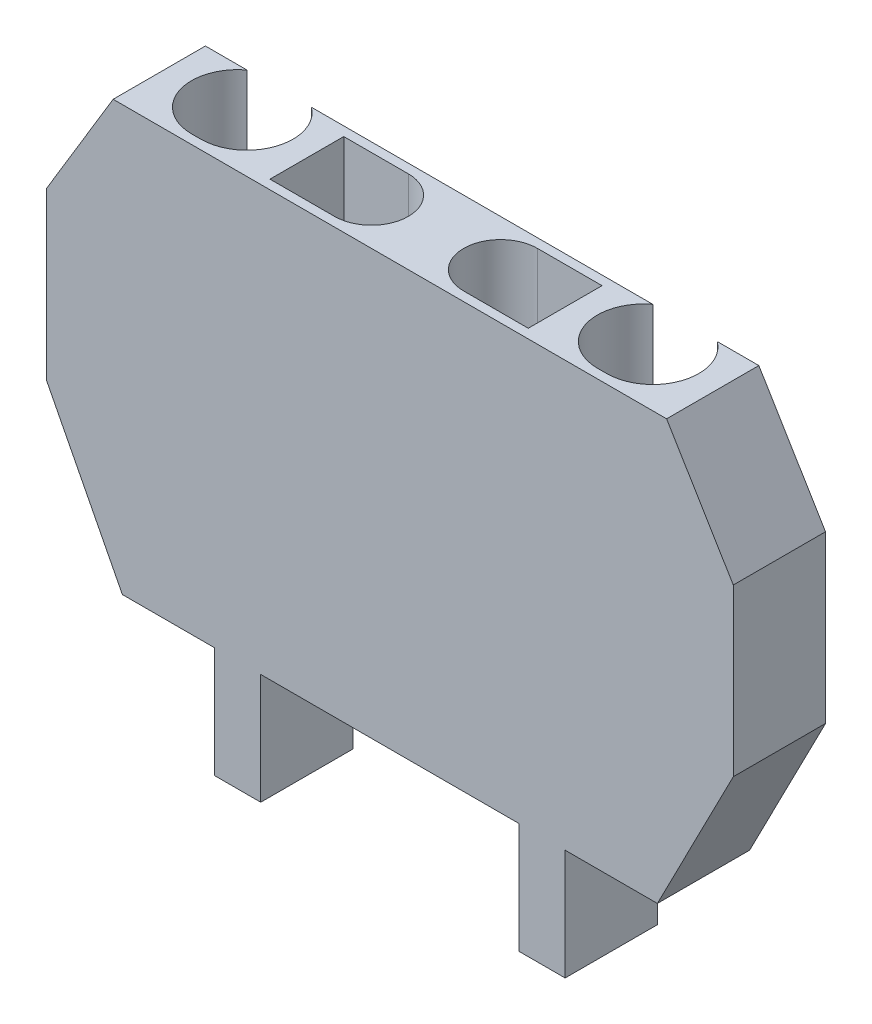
ISO-10303-21;
HEADER;
FILE_DESCRIPTION(('STEP AP214'),'2;1');
FILE_NAME('part.step','',(''),(''),'','','');
FILE_SCHEMA(('AUTOMOTIVE_DESIGN { 1 0 10303 214 1 1 1 1 }'));
ENDSEC;
DATA;
#1=APPLICATION_CONTEXT('core data for automotive mechanical design processes');
#2=APPLICATION_PROTOCOL_DEFINITION('international standard','automotive_design',2000,#1);
#3=PRODUCT_CONTEXT('',#1,'mechanical');
#4=PRODUCT('Part','Part','',(#3));
#5=PRODUCT_RELATED_PRODUCT_CATEGORY('part','',(#4));
#6=PRODUCT_DEFINITION_FORMATION('','',#4);
#7=PRODUCT_DEFINITION_CONTEXT('part definition',#1,'design');
#8=PRODUCT_DEFINITION('design','',#6,#7);
#9=PRODUCT_DEFINITION_SHAPE('','',#8);
#10=(LENGTH_UNIT() NAMED_UNIT(*) SI_UNIT(.MILLI.,.METRE.));
#11=(NAMED_UNIT(*) PLANE_ANGLE_UNIT() SI_UNIT($,.RADIAN.));
#12=(NAMED_UNIT(*) SI_UNIT($,.STERADIAN.) SOLID_ANGLE_UNIT());
#13=UNCERTAINTY_MEASURE_WITH_UNIT(LENGTH_MEASURE(1.E-05),#10,'distance_accuracy_value','');
#14=(GEOMETRIC_REPRESENTATION_CONTEXT(3) GLOBAL_UNCERTAINTY_ASSIGNED_CONTEXT((#13)) GLOBAL_UNIT_ASSIGNED_CONTEXT((#10,
#11,#12)) REPRESENTATION_CONTEXT('',''));
#15=CARTESIAN_POINT('',(0.,0.,0.));
#16=DIRECTION('',(0.,0.,1.));
#17=DIRECTION('',(1.,0.,0.));
#18=AXIS2_PLACEMENT_3D('',#15,#16,#17);
#19=CARTESIAN_POINT('',(7.,0.,5.));
#20=DIRECTION('',(1.,0.,0.));
#21=DIRECTION('',(0.,1.,0.));
#22=AXIS2_PLACEMENT_3D('',#19,#20,#21);
#23=PLANE('',#22);
#24=DIRECTION('',(0.,-1.,0.));
#25=VECTOR('',#24,1.);
#26=CARTESIAN_POINT('',(7.,0.,0.));
#27=LINE('',#26,#25);
#28=CARTESIAN_POINT('',(7.,0.,0.));
#29=VERTEX_POINT('',#28);
#30=CARTESIAN_POINT('',(7.,-6.,0.));
#31=VERTEX_POINT('',#30);
#32=EDGE_CURVE('E333',#29,#31,#27,.T.);
#33=ORIENTED_EDGE('',*,*,#32,.T.);
#34=DIRECTION('',(0.,0.,-1.));
#35=VECTOR('',#34,1.);
#36=CARTESIAN_POINT('',(7.,-6.,5.));
#37=LINE('',#36,#35);
#38=CARTESIAN_POINT('',(7.,-6.,5.));
#39=VERTEX_POINT('',#38);
#40=EDGE_CURVE('E449',#39,#31,#37,.T.);
#41=ORIENTED_EDGE('',*,*,#40,.F.);
#42=DIRECTION('',(0.,-1.,0.));
#43=VECTOR('',#42,1.);
#44=CARTESIAN_POINT('',(7.,0.,5.));
#45=LINE('',#44,#43);
#46=CARTESIAN_POINT('',(7.,0.,5.));
#47=VERTEX_POINT('',#46);
#48=EDGE_CURVE('E336',#47,#39,#45,.T.);
#49=ORIENTED_EDGE('',*,*,#48,.F.);
#50=DIRECTION('',(0.,0.,-1.));
#51=VECTOR('',#50,1.);
#52=CARTESIAN_POINT('',(7.,0.,5.));
#53=LINE('',#52,#51);
#54=EDGE_CURVE('E370',#47,#29,#53,.T.);
#55=ORIENTED_EDGE('',*,*,#54,.T.);
#56=EDGE_LOOP('',(#33,#41,#49,#55));
#57=FACE_BOUND('',#56,.T.);
#58=ADVANCED_FACE('F17',(#57),#23,.F.);
#59=CARTESIAN_POINT('',(7.,-6.,5.));
#60=DIRECTION('',(0.,1.,0.));
#61=DIRECTION('',(0.,0.,1.));
#62=AXIS2_PLACEMENT_3D('',#59,#60,#61);
#63=PLANE('',#62);
#64=DIRECTION('',(1.,0.,0.));
#65=VECTOR('',#64,1.);
#66=CARTESIAN_POINT('',(7.,-6.,0.));
#67=LINE('',#66,#65);
#68=CARTESIAN_POINT('',(9.5,-6.,0.));
#69=VERTEX_POINT('',#68);
#70=EDGE_CURVE('E373',#31,#69,#67,.T.);
#71=ORIENTED_EDGE('',*,*,#70,.T.);
#72=DIRECTION('',(0.,0.,-1.));
#73=VECTOR('',#72,1.);
#74=CARTESIAN_POINT('',(9.5,-6.,5.));
#75=LINE('',#74,#73);
#76=CARTESIAN_POINT('',(9.5,-6.,5.));
#77=VERTEX_POINT('',#76);
#78=EDGE_CURVE('E446',#77,#69,#75,.T.);
#79=ORIENTED_EDGE('',*,*,#78,.F.);
#80=DIRECTION('',(1.,0.,0.));
#81=VECTOR('',#80,1.);
#82=CARTESIAN_POINT('',(7.,-6.,5.));
#83=LINE('',#82,#81);
#84=EDGE_CURVE('E339',#39,#77,#83,.T.);
#85=ORIENTED_EDGE('',*,*,#84,.F.);
#86=ORIENTED_EDGE('',*,*,#40,.T.);
#87=EDGE_LOOP('',(#71,#79,#85,#86));
#88=FACE_BOUND('',#87,.T.);
#89=ADVANCED_FACE('F500',(#88),#63,.F.);
#90=CARTESIAN_POINT('',(9.5,-6.,5.));
#91=DIRECTION('',(-1.,0.,0.));
#92=DIRECTION('',(0.,0.,1.));
#93=AXIS2_PLACEMENT_3D('',#90,#91,#92);
#94=PLANE('',#93);
#95=DIRECTION('',(0.,1.,0.));
#96=VECTOR('',#95,1.);
#97=CARTESIAN_POINT('',(9.5,-6.,0.));
#98=LINE('',#97,#96);
#99=CARTESIAN_POINT('',(9.5,0.,0.));
#100=VERTEX_POINT('',#99);
#101=EDGE_CURVE('E375',#69,#100,#98,.T.);
#102=ORIENTED_EDGE('',*,*,#101,.T.);
#103=DIRECTION('',(0.,0.,-1.));
#104=VECTOR('',#103,1.);
#105=CARTESIAN_POINT('',(9.5,0.,5.));
#106=LINE('',#105,#104);
#107=CARTESIAN_POINT('',(9.5,0.,5.));
#108=VERTEX_POINT('',#107);
#109=EDGE_CURVE('E443',#108,#100,#106,.T.);
#110=ORIENTED_EDGE('',*,*,#109,.F.);
#111=DIRECTION('',(0.,1.,0.));
#112=VECTOR('',#111,1.);
#113=CARTESIAN_POINT('',(9.5,-6.,5.));
#114=LINE('',#113,#112);
#115=EDGE_CURVE('E342',#77,#108,#114,.T.);
#116=ORIENTED_EDGE('',*,*,#115,.F.);
#117=ORIENTED_EDGE('',*,*,#78,.T.);
#118=EDGE_LOOP('',(#102,#110,#116,#117));
#119=FACE_BOUND('',#118,.T.);
#120=ADVANCED_FACE('F496',(#119),#94,.F.);
#121=CARTESIAN_POINT('',(9.5,0.,5.));
#122=DIRECTION('',(0.,1.,0.));
#123=DIRECTION('',(0.,0.,1.));
#124=AXIS2_PLACEMENT_3D('',#121,#122,#123);
#125=PLANE('',#124);
#126=DIRECTION('',(1.,0.,0.));
#127=VECTOR('',#126,1.);
#128=CARTESIAN_POINT('',(9.5,0.,0.));
#129=LINE('',#128,#127);
#130=CARTESIAN_POINT('',(14.5,0.,0.));
#131=VERTEX_POINT('',#130);
#132=EDGE_CURVE('E377',#100,#131,#129,.T.);
#133=ORIENTED_EDGE('',*,*,#132,.T.);
#134=DIRECTION('',(0.,0.,-1.));
#135=VECTOR('',#134,1.);
#136=CARTESIAN_POINT('',(14.5,0.,5.));
#137=LINE('',#136,#135);
#138=CARTESIAN_POINT('',(14.5,0.,5.));
#139=VERTEX_POINT('',#138);
#140=EDGE_CURVE('E440',#139,#131,#137,.T.);
#141=ORIENTED_EDGE('',*,*,#140,.F.);
#142=DIRECTION('',(1.,0.,0.));
#143=VECTOR('',#142,1.);
#144=CARTESIAN_POINT('',(9.5,0.,5.));
#145=LINE('',#144,#143);
#146=EDGE_CURVE('E344',#108,#139,#145,.T.);
#147=ORIENTED_EDGE('',*,*,#146,.F.);
#148=ORIENTED_EDGE('',*,*,#109,.T.);
#149=EDGE_LOOP('',(#133,#141,#147,#148));
#150=FACE_BOUND('',#149,.T.);
#151=ADVANCED_FACE('F491',(#150),#125,.F.);
#152=CARTESIAN_POINT('',(14.5,0.,5.));
#153=DIRECTION('',(-0.889429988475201,0.457071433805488,0.));
#154=DIRECTION('',(-0.457071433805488,-0.889429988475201,0.));
#155=AXIS2_PLACEMENT_3D('',#152,#153,#154);
#156=PLANE('',#155);
#157=DIRECTION('',(0.457071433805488,0.889429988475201,0.));
#158=VECTOR('',#157,1.);
#159=CARTESIAN_POINT('',(14.5,0.,0.));
#160=LINE('',#159,#158);
#161=CARTESIAN_POINT('',(18.6136429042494,8.0048698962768,0.));
#162=VERTEX_POINT('',#161);
#163=EDGE_CURVE('E379',#131,#162,#160,.T.);
#164=ORIENTED_EDGE('',*,*,#163,.T.);
#165=DIRECTION('',(0.,0.,-1.));
#166=VECTOR('',#165,1.);
#167=CARTESIAN_POINT('',(18.6136429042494,8.0048698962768,5.));
#168=LINE('',#167,#166);
#169=CARTESIAN_POINT('',(18.6136429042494,8.0048698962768,5.));
#170=VERTEX_POINT('',#169);
#171=EDGE_CURVE('E437',#170,#162,#168,.T.);
#172=ORIENTED_EDGE('',*,*,#171,.F.);
#173=DIRECTION('',(0.457071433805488,0.889429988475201,0.));
#174=VECTOR('',#173,1.);
#175=CARTESIAN_POINT('',(14.5,0.,5.));
#176=LINE('',#175,#174);
#177=EDGE_CURVE('E346',#139,#170,#176,.T.);
#178=ORIENTED_EDGE('',*,*,#177,.F.);
#179=ORIENTED_EDGE('',*,*,#140,.T.);
#180=EDGE_LOOP('',(#164,#172,#178,#179));
#181=FACE_BOUND('',#180,.T.);
#182=ADVANCED_FACE('F487',(#181),#156,.F.);
#183=CARTESIAN_POINT('',(18.6136429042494,8.0048698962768,5.));
#184=DIRECTION('',(-1.,0.,0.));
#185=DIRECTION('',(0.,0.,1.));
#186=AXIS2_PLACEMENT_3D('',#183,#184,#185);
#187=PLANE('',#186);
#188=DIRECTION('',(0.,1.,0.));
#189=VECTOR('',#188,1.);
#190=CARTESIAN_POINT('',(18.6136429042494,8.0048698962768,0.));
#191=LINE('',#190,#189);
#192=CARTESIAN_POINT('',(18.6136429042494,17.0048698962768,0.));
#193=VERTEX_POINT('',#192);
#194=EDGE_CURVE('E381',#162,#193,#191,.T.);
#195=ORIENTED_EDGE('',*,*,#194,.T.);
#196=DIRECTION('',(0.,0.,-1.));
#197=VECTOR('',#196,1.);
#198=CARTESIAN_POINT('',(18.6136429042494,17.0048698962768,5.));
#199=LINE('',#198,#197);
#200=CARTESIAN_POINT('',(18.6136429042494,17.0048698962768,5.));
#201=VERTEX_POINT('',#200);
#202=EDGE_CURVE('E434',#201,#193,#199,.T.);
#203=ORIENTED_EDGE('',*,*,#202,.F.);
#204=DIRECTION('',(0.,1.,0.));
#205=VECTOR('',#204,1.);
#206=CARTESIAN_POINT('',(18.6136429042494,8.0048698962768,5.));
#207=LINE('',#206,#205);
#208=EDGE_CURVE('E348',#170,#201,#207,.T.);
#209=ORIENTED_EDGE('',*,*,#208,.F.);
#210=ORIENTED_EDGE('',*,*,#171,.T.);
#211=EDGE_LOOP('',(#195,#203,#209,#210));
#212=FACE_BOUND('',#211,.T.);
#213=ADVANCED_FACE('F482',(#212),#187,.F.);
#214=CARTESIAN_POINT('',(18.6136429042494,17.0048698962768,5.));
#215=DIRECTION('',(-0.856447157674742,-0.516234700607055,0.));
#216=DIRECTION('',(0.516234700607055,-0.856447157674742,0.));
#217=AXIS2_PLACEMENT_3D('',#214,#215,#216);
#218=PLANE('',#217);
#219=DIRECTION('',(-0.516234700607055,0.856447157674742,0.));
#220=VECTOR('',#219,1.);
#221=CARTESIAN_POINT('',(18.6136429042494,17.0048698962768,0.));
#222=LINE('',#221,#220);
#223=CARTESIAN_POINT('',(15.,23.,0.));
#224=VERTEX_POINT('',#223);
#225=EDGE_CURVE('E383',#193,#224,#222,.T.);
#226=ORIENTED_EDGE('',*,*,#225,.T.);
#227=DIRECTION('',(0.,0.,-1.));
#228=VECTOR('',#227,1.);
#229=CARTESIAN_POINT('',(15.,23.,5.));
#230=LINE('',#229,#228);
#231=CARTESIAN_POINT('',(15.,23.,5.));
#232=VERTEX_POINT('',#231);
#233=EDGE_CURVE('E431',#232,#224,#230,.T.);
#234=ORIENTED_EDGE('',*,*,#233,.F.);
#235=DIRECTION('',(-0.516234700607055,0.856447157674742,0.));
#236=VECTOR('',#235,1.);
#237=CARTESIAN_POINT('',(18.6136429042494,17.0048698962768,5.));
#238=LINE('',#237,#236);
#239=EDGE_CURVE('E350',#201,#232,#238,.T.);
#240=ORIENTED_EDGE('',*,*,#239,.F.);
#241=ORIENTED_EDGE('',*,*,#202,.T.);
#242=EDGE_LOOP('',(#226,#234,#240,#241));
#243=FACE_BOUND('',#242,.T.);
#244=ADVANCED_FACE('F476',(#243),#218,.F.);
#245=CARTESIAN_POINT('',(15.,23.,5.));
#246=DIRECTION('',(0.,-1.,0.));
#247=DIRECTION('',(0.,0.,-1.));
#248=AXIS2_PLACEMENT_3D('',#245,#246,#247);
#249=PLANE('',#248);
#250=DIRECTION('',(1.,0.,0.));
#251=VECTOR('',#250,1.);
#252=CARTESIAN_POINT('',(7.,23.,4.5));
#253=LINE('',#252,#251);
#254=CARTESIAN_POINT('',(3.5,23.,4.5));
#255=VERTEX_POINT('',#254);
#256=CARTESIAN_POINT('',(7.,23.,4.5));
#257=VERTEX_POINT('',#256);
#258=EDGE_CURVE('E268',#255,#257,#253,.T.);
#259=ORIENTED_EDGE('',*,*,#258,.F.);
#260=CARTESIAN_POINT('',(3.5,23.,2.5));
#261=DIRECTION('',(0.,1.,0.));
#262=DIRECTION('',(0.,0.,-1.));
#263=AXIS2_PLACEMENT_3D('',#260,#261,#262);
#264=CIRCLE('',#263,2.);
#265=CARTESIAN_POINT('',(3.5,23.,0.5));
#266=VERTEX_POINT('',#265);
#267=EDGE_CURVE('E39',#266,#255,#264,.T.);
#268=ORIENTED_EDGE('',*,*,#267,.F.);
#269=DIRECTION('',(-1.,0.,0.));
#270=VECTOR('',#269,1.);
#271=CARTESIAN_POINT('',(3.5,23.,0.5));
#272=LINE('',#271,#270);
#273=CARTESIAN_POINT('',(7.,23.,0.5));
#274=VERTEX_POINT('',#273);
#275=EDGE_CURVE('E257',#274,#266,#272,.T.);
#276=ORIENTED_EDGE('',*,*,#275,.F.);
#277=DIRECTION('',(0.,0.,-1.));
#278=VECTOR('',#277,1.);
#279=CARTESIAN_POINT('',(7.,23.,0.5));
#280=LINE('',#279,#278);
#281=EDGE_CURVE('E271',#257,#274,#280,.T.);
#282=ORIENTED_EDGE('',*,*,#281,.F.);
#283=EDGE_LOOP('',(#259,#268,#276,#282));
#284=FACE_BOUND('',#283,.T.);
#285=DIRECTION('',(0.,0.,1.));
#286=VECTOR('',#285,1.);
#287=CARTESIAN_POINT('',(-7.,23.,0.5));
#288=LINE('',#287,#286);
#289=CARTESIAN_POINT('',(-7.,23.,0.5));
#290=VERTEX_POINT('',#289);
#291=CARTESIAN_POINT('',(-7.,23.,4.5));
#292=VERTEX_POINT('',#291);
#293=EDGE_CURVE('E299',#290,#292,#288,.T.);
#294=ORIENTED_EDGE('',*,*,#293,.F.);
#295=DIRECTION('',(-1.,0.,0.));
#296=VECTOR('',#295,1.);
#297=CARTESIAN_POINT('',(-3.5,23.,0.5));
#298=LINE('',#297,#296);
#299=CARTESIAN_POINT('',(-3.5,23.,0.5));
#300=VERTEX_POINT('',#299);
#301=EDGE_CURVE('E278',#300,#290,#298,.T.);
#302=ORIENTED_EDGE('',*,*,#301,.F.);
#303=CARTESIAN_POINT('',(-3.5,23.,2.5));
#304=DIRECTION('',(0.,1.,0.));
#305=DIRECTION('',(0.,0.,1.));
#306=AXIS2_PLACEMENT_3D('',#303,#304,#305);
#307=CIRCLE('',#306,2.);
#308=CARTESIAN_POINT('',(-3.5,23.,4.5));
#309=VERTEX_POINT('',#308);
#310=EDGE_CURVE('E288',#309,#300,#307,.T.);
#311=ORIENTED_EDGE('',*,*,#310,.F.);
#312=DIRECTION('',(1.,0.,0.));
#313=VECTOR('',#312,1.);
#314=CARTESIAN_POINT('',(-7.,23.,4.5));
#315=LINE('',#314,#313);
#316=EDGE_CURVE('E302',#292,#309,#315,.T.);
#317=ORIENTED_EDGE('',*,*,#316,.F.);
#318=EDGE_LOOP('',(#294,#302,#311,#317));
#319=FACE_BOUND('',#318,.T.);
#320=DIRECTION('',(1.,0.,0.));
#321=VECTOR('',#320,1.);
#322=CARTESIAN_POINT('',(10.75,23.,4.5));
#323=LINE('',#322,#321);
#324=CARTESIAN_POINT('',(10.75,23.,4.5));
#325=VERTEX_POINT('',#324);
#326=CARTESIAN_POINT('',(11.25,23.,4.5));
#327=VERTEX_POINT('',#326);
#328=EDGE_CURVE('E249',#325,#327,#323,.T.);
#329=ORIENTED_EDGE('',*,*,#328,.F.);
#330=CARTESIAN_POINT('',(10.75,23.,2.));
#331=DIRECTION('',(0.,1.,0.));
#332=DIRECTION('',(0.,0.,1.));
#333=AXIS2_PLACEMENT_3D('',#330,#331,#332);
#334=CIRCLE('',#333,2.5);
#335=CARTESIAN_POINT('',(9.25,23.,0.));
#336=VERTEX_POINT('',#335);
#337=EDGE_CURVE('E238',#336,#325,#334,.T.);
#338=ORIENTED_EDGE('',*,*,#337,.F.);
#339=DIRECTION('',(-1.,0.,0.));
#340=VECTOR('',#339,1.);
#341=CARTESIAN_POINT('',(15.,23.,0.));
#342=LINE('',#341,#340);
#343=CARTESIAN_POINT('',(-9.25,23.,0.));
#344=VERTEX_POINT('',#343);
#345=EDGE_CURVE('E390',#336,#344,#342,.T.);
#346=ORIENTED_EDGE('',*,*,#345,.T.);
#347=CARTESIAN_POINT('',(-10.75,23.,2.));
#348=DIRECTION('',(0.,1.,0.));
#349=DIRECTION('',(0.,0.,-1.));
#350=AXIS2_PLACEMENT_3D('',#347,#348,#349);
#351=CIRCLE('',#350,2.5);
#352=CARTESIAN_POINT('',(-10.75,23.,4.5));
#353=VERTEX_POINT('',#352);
#354=EDGE_CURVE('E319',#353,#344,#351,.T.);
#355=ORIENTED_EDGE('',*,*,#354,.F.);
#356=DIRECTION('',(1.,0.,0.));
#357=VECTOR('',#356,1.);
#358=CARTESIAN_POINT('',(-10.75,23.,4.5));
#359=LINE('',#358,#357);
#360=CARTESIAN_POINT('',(-11.25,23.,4.5));
#361=VERTEX_POINT('',#360);
#362=EDGE_CURVE('E326',#361,#353,#359,.T.);
#363=ORIENTED_EDGE('',*,*,#362,.F.);
#364=CARTESIAN_POINT('',(-11.25,23.,2.));
#365=DIRECTION('',(0.,1.,0.));
#366=DIRECTION('',(0.,0.,-1.));
#367=AXIS2_PLACEMENT_3D('',#364,#365,#366);
#368=CIRCLE('',#367,2.5);
#369=CARTESIAN_POINT('',(-12.75,23.,0.));
#370=VERTEX_POINT('',#369);
#371=EDGE_CURVE('E309',#370,#361,#368,.T.);
#372=ORIENTED_EDGE('',*,*,#371,.F.);
#373=CARTESIAN_POINT('',(-15.,23.,0.));
#374=VERTEX_POINT('',#373);
#375=EDGE_CURVE('E385',#370,#374,#342,.T.);
#376=ORIENTED_EDGE('',*,*,#375,.T.);
#377=DIRECTION('',(0.,0.,-1.));
#378=VECTOR('',#377,1.);
#379=CARTESIAN_POINT('',(-15.,23.,5.));
#380=LINE('',#379,#378);
#381=CARTESIAN_POINT('',(-15.,23.,5.));
#382=VERTEX_POINT('',#381);
#383=EDGE_CURVE('E428',#382,#374,#380,.T.);
#384=ORIENTED_EDGE('',*,*,#383,.F.);
#385=DIRECTION('',(-1.,0.,0.));
#386=VECTOR('',#385,1.);
#387=CARTESIAN_POINT('',(15.,23.,5.));
#388=LINE('',#387,#386);
#389=EDGE_CURVE('E352',#232,#382,#388,.T.);
#390=ORIENTED_EDGE('',*,*,#389,.F.);
#391=ORIENTED_EDGE('',*,*,#233,.T.);
#392=CARTESIAN_POINT('',(12.75,23.,0.));
#393=VERTEX_POINT('',#392);
#394=EDGE_CURVE('E386',#224,#393,#342,.T.);
#395=ORIENTED_EDGE('',*,*,#394,.T.);
#396=CARTESIAN_POINT('',(11.25,23.,2.));
#397=DIRECTION('',(0.,1.,0.));
#398=DIRECTION('',(0.,0.,1.));
#399=AXIS2_PLACEMENT_3D('',#396,#397,#398);
#400=CIRCLE('',#399,2.5);
#401=EDGE_CURVE('E232',#327,#393,#400,.T.);
#402=ORIENTED_EDGE('',*,*,#401,.F.);
#403=EDGE_LOOP('',(#329,#338,#346,#355,#363,#372,#376,#384,#390,#391,#395,#402));
#404=FACE_BOUND('',#403,.T.);
#405=ADVANCED_FACE('F470',(#284,#319,#404),#249,.F.);
#406=CARTESIAN_POINT('',(-18.6136429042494,17.0048698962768,5.));
#407=DIRECTION('',(0.856447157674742,-0.516234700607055,0.));
#408=DIRECTION('',(0.516234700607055,0.856447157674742,0.));
#409=AXIS2_PLACEMENT_3D('',#406,#407,#408);
#410=PLANE('',#409);
#411=DIRECTION('',(-0.516234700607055,-0.856447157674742,0.));
#412=VECTOR('',#411,1.);
#413=CARTESIAN_POINT('',(-18.6136429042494,17.0048698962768,0.));
#414=LINE('',#413,#412);
#415=CARTESIAN_POINT('',(-18.6136429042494,17.0048698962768,0.));
#416=VERTEX_POINT('',#415);
#417=EDGE_CURVE('E389',#374,#416,#414,.T.);
#418=ORIENTED_EDGE('',*,*,#417,.T.);
#419=DIRECTION('',(0.,0.,-1.));
#420=VECTOR('',#419,1.);
#421=CARTESIAN_POINT('',(-18.6136429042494,17.0048698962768,5.));
#422=LINE('',#421,#420);
#423=CARTESIAN_POINT('',(-18.6136429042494,17.0048698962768,5.));
#424=VERTEX_POINT('',#423);
#425=EDGE_CURVE('E425',#424,#416,#422,.T.);
#426=ORIENTED_EDGE('',*,*,#425,.F.);
#427=DIRECTION('',(-0.516234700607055,-0.856447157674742,0.));
#428=VECTOR('',#427,1.);
#429=CARTESIAN_POINT('',(-18.6136429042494,17.0048698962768,5.));
#430=LINE('',#429,#428);
#431=EDGE_CURVE('E354',#382,#424,#430,.T.);
#432=ORIENTED_EDGE('',*,*,#431,.F.);
#433=ORIENTED_EDGE('',*,*,#383,.T.);
#434=EDGE_LOOP('',(#418,#426,#432,#433));
#435=FACE_BOUND('',#434,.T.);
#436=ADVANCED_FACE('F544',(#435),#410,.F.);
#437=CARTESIAN_POINT('',(-18.6136429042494,8.0048698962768,5.));
#438=DIRECTION('',(1.,0.,0.));
#439=DIRECTION('',(0.,0.,-1.));
#440=AXIS2_PLACEMENT_3D('',#437,#438,#439);
#441=PLANE('',#440);
#442=DIRECTION('',(0.,-1.,0.));
#443=VECTOR('',#442,1.);
#444=CARTESIAN_POINT('',(-18.6136429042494,8.0048698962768,0.));
#445=LINE('',#444,#443);
#446=CARTESIAN_POINT('',(-18.6136429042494,8.0048698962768,0.));
#447=VERTEX_POINT('',#446);
#448=EDGE_CURVE('E392',#416,#447,#445,.T.);
#449=ORIENTED_EDGE('',*,*,#448,.T.);
#450=DIRECTION('',(0.,0.,-1.));
#451=VECTOR('',#450,1.);
#452=CARTESIAN_POINT('',(-18.6136429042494,8.0048698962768,5.));
#453=LINE('',#452,#451);
#454=CARTESIAN_POINT('',(-18.6136429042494,8.0048698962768,5.));
#455=VERTEX_POINT('',#454);
#456=EDGE_CURVE('E422',#455,#447,#453,.T.);
#457=ORIENTED_EDGE('',*,*,#456,.F.);
#458=DIRECTION('',(0.,-1.,0.));
#459=VECTOR('',#458,1.);
#460=CARTESIAN_POINT('',(-18.6136429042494,8.0048698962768,5.));
#461=LINE('',#460,#459);
#462=EDGE_CURVE('E356',#424,#455,#461,.T.);
#463=ORIENTED_EDGE('',*,*,#462,.F.);
#464=ORIENTED_EDGE('',*,*,#425,.T.);
#465=EDGE_LOOP('',(#449,#457,#463,#464));
#466=FACE_BOUND('',#465,.T.);
#467=ADVANCED_FACE('F539',(#466),#441,.F.);
#468=CARTESIAN_POINT('',(-14.5,0.,5.));
#469=DIRECTION('',(0.889429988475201,0.457071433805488,0.));
#470=DIRECTION('',(-0.457071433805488,0.889429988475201,0.));
#471=AXIS2_PLACEMENT_3D('',#468,#469,#470);
#472=PLANE('',#471);
#473=DIRECTION('',(0.457071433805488,-0.889429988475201,0.));
#474=VECTOR('',#473,1.);
#475=CARTESIAN_POINT('',(-14.5,0.,0.));
#476=LINE('',#475,#474);
#477=CARTESIAN_POINT('',(-14.5,0.,0.));
#478=VERTEX_POINT('',#477);
#479=EDGE_CURVE('E394',#447,#478,#476,.T.);
#480=ORIENTED_EDGE('',*,*,#479,.T.);
#481=DIRECTION('',(0.,0.,-1.));
#482=VECTOR('',#481,1.);
#483=CARTESIAN_POINT('',(-14.5,0.,5.));
#484=LINE('',#483,#482);
#485=CARTESIAN_POINT('',(-14.5,0.,5.));
#486=VERTEX_POINT('',#485);
#487=EDGE_CURVE('E419',#486,#478,#484,.T.);
#488=ORIENTED_EDGE('',*,*,#487,.F.);
#489=DIRECTION('',(0.457071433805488,-0.889429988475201,0.));
#490=VECTOR('',#489,1.);
#491=CARTESIAN_POINT('',(-14.5,0.,5.));
#492=LINE('',#491,#490);
#493=EDGE_CURVE('E358',#455,#486,#492,.T.);
#494=ORIENTED_EDGE('',*,*,#493,.F.);
#495=ORIENTED_EDGE('',*,*,#456,.T.);
#496=EDGE_LOOP('',(#480,#488,#494,#495));
#497=FACE_BOUND('',#496,.T.);
#498=ADVANCED_FACE('F533',(#497),#472,.F.);
#499=CARTESIAN_POINT('',(-9.5,0.,5.));
#500=DIRECTION('',(0.,1.,0.));
#501=DIRECTION('',(0.,0.,1.));
#502=AXIS2_PLACEMENT_3D('',#499,#500,#501);
#503=PLANE('',#502);
#504=DIRECTION('',(1.,0.,0.));
#505=VECTOR('',#504,1.);
#506=CARTESIAN_POINT('',(-9.5,0.,0.));
#507=LINE('',#506,#505);
#508=CARTESIAN_POINT('',(-9.5,0.,0.));
#509=VERTEX_POINT('',#508);
#510=EDGE_CURVE('E396',#478,#509,#507,.T.);
#511=ORIENTED_EDGE('',*,*,#510,.T.);
#512=DIRECTION('',(0.,0.,-1.));
#513=VECTOR('',#512,1.);
#514=CARTESIAN_POINT('',(-9.5,0.,5.));
#515=LINE('',#514,#513);
#516=CARTESIAN_POINT('',(-9.5,0.,5.));
#517=VERTEX_POINT('',#516);
#518=EDGE_CURVE('E416',#517,#509,#515,.T.);
#519=ORIENTED_EDGE('',*,*,#518,.F.);
#520=DIRECTION('',(1.,0.,0.));
#521=VECTOR('',#520,1.);
#522=CARTESIAN_POINT('',(-9.5,0.,5.));
#523=LINE('',#522,#521);
#524=EDGE_CURVE('E360',#486,#517,#523,.T.);
#525=ORIENTED_EDGE('',*,*,#524,.F.);
#526=ORIENTED_EDGE('',*,*,#487,.T.);
#527=EDGE_LOOP('',(#511,#519,#525,#526));
#528=FACE_BOUND('',#527,.T.);
#529=ADVANCED_FACE('F529',(#528),#503,.F.);
#530=CARTESIAN_POINT('',(-9.5,-6.,5.));
#531=DIRECTION('',(1.,0.,0.));
#532=DIRECTION('',(0.,0.,-1.));
#533=AXIS2_PLACEMENT_3D('',#530,#531,#532);
#534=PLANE('',#533);
#535=DIRECTION('',(0.,-1.,0.));
#536=VECTOR('',#535,1.);
#537=CARTESIAN_POINT('',(-9.5,-6.,0.));
#538=LINE('',#537,#536);
#539=CARTESIAN_POINT('',(-9.5,-6.,0.));
#540=VERTEX_POINT('',#539);
#541=EDGE_CURVE('E398',#509,#540,#538,.T.);
#542=ORIENTED_EDGE('',*,*,#541,.T.);
#543=DIRECTION('',(0.,0.,-1.));
#544=VECTOR('',#543,1.);
#545=CARTESIAN_POINT('',(-9.5,-6.,5.));
#546=LINE('',#545,#544);
#547=CARTESIAN_POINT('',(-9.5,-6.,5.));
#548=VERTEX_POINT('',#547);
#549=EDGE_CURVE('E413',#548,#540,#546,.T.);
#550=ORIENTED_EDGE('',*,*,#549,.F.);
#551=DIRECTION('',(0.,-1.,0.));
#552=VECTOR('',#551,1.);
#553=CARTESIAN_POINT('',(-9.5,-6.,5.));
#554=LINE('',#553,#552);
#555=EDGE_CURVE('E362',#517,#548,#554,.T.);
#556=ORIENTED_EDGE('',*,*,#555,.F.);
#557=ORIENTED_EDGE('',*,*,#518,.T.);
#558=EDGE_LOOP('',(#542,#550,#556,#557));
#559=FACE_BOUND('',#558,.T.);
#560=ADVANCED_FACE('F524',(#559),#534,.F.);
#561=CARTESIAN_POINT('',(-7.,-6.,5.));
#562=DIRECTION('',(0.,1.,0.));
#563=DIRECTION('',(0.,0.,1.));
#564=AXIS2_PLACEMENT_3D('',#561,#562,#563);
#565=PLANE('',#564);
#566=DIRECTION('',(1.,0.,0.));
#567=VECTOR('',#566,1.);
#568=CARTESIAN_POINT('',(-7.,-6.,0.));
#569=LINE('',#568,#567);
#570=CARTESIAN_POINT('',(-7.,-6.,0.));
#571=VERTEX_POINT('',#570);
#572=EDGE_CURVE('E400',#540,#571,#569,.T.);
#573=ORIENTED_EDGE('',*,*,#572,.T.);
#574=DIRECTION('',(0.,0.,-1.));
#575=VECTOR('',#574,1.);
#576=CARTESIAN_POINT('',(-7.,-6.,5.));
#577=LINE('',#576,#575);
#578=CARTESIAN_POINT('',(-7.,-6.,5.));
#579=VERTEX_POINT('',#578);
#580=EDGE_CURVE('E410',#579,#571,#577,.T.);
#581=ORIENTED_EDGE('',*,*,#580,.F.);
#582=DIRECTION('',(1.,0.,0.));
#583=VECTOR('',#582,1.);
#584=CARTESIAN_POINT('',(-7.,-6.,5.));
#585=LINE('',#584,#583);
#586=EDGE_CURVE('E364',#548,#579,#585,.T.);
#587=ORIENTED_EDGE('',*,*,#586,.F.);
#588=ORIENTED_EDGE('',*,*,#549,.T.);
#589=EDGE_LOOP('',(#573,#581,#587,#588));
#590=FACE_BOUND('',#589,.T.);
#591=ADVANCED_FACE('F518',(#590),#565,.F.);
#592=CARTESIAN_POINT('',(-7.,0.,5.));
#593=DIRECTION('',(-1.,0.,0.));
#594=DIRECTION('',(0.,-1.,0.));
#595=AXIS2_PLACEMENT_3D('',#592,#593,#594);
#596=PLANE('',#595);
#597=DIRECTION('',(0.,1.,0.));
#598=VECTOR('',#597,1.);
#599=CARTESIAN_POINT('',(-7.,0.,0.));
#600=LINE('',#599,#598);
#601=CARTESIAN_POINT('',(-7.,0.,0.));
#602=VERTEX_POINT('',#601);
#603=EDGE_CURVE('E402',#571,#602,#600,.T.);
#604=ORIENTED_EDGE('',*,*,#603,.T.);
#605=DIRECTION('',(0.,0.,-1.));
#606=VECTOR('',#605,1.);
#607=CARTESIAN_POINT('',(-7.,0.,5.));
#608=LINE('',#607,#606);
#609=CARTESIAN_POINT('',(-7.,0.,5.));
#610=VERTEX_POINT('',#609);
#611=EDGE_CURVE('E407',#610,#602,#608,.T.);
#612=ORIENTED_EDGE('',*,*,#611,.F.);
#613=DIRECTION('',(0.,1.,0.));
#614=VECTOR('',#613,1.);
#615=CARTESIAN_POINT('',(-7.,0.,5.));
#616=LINE('',#615,#614);
#617=EDGE_CURVE('E366',#579,#610,#616,.T.);
#618=ORIENTED_EDGE('',*,*,#617,.F.);
#619=ORIENTED_EDGE('',*,*,#580,.T.);
#620=EDGE_LOOP('',(#604,#612,#618,#619));
#621=FACE_BOUND('',#620,.T.);
#622=ADVANCED_FACE('F514',(#621),#596,.F.);
#623=CARTESIAN_POINT('',(-7.,0.,5.));
#624=DIRECTION('',(0.,1.,0.));
#625=DIRECTION('',(0.,0.,1.));
#626=AXIS2_PLACEMENT_3D('',#623,#624,#625);
#627=PLANE('',#626);
#628=DIRECTION('',(1.,0.,0.));
#629=VECTOR('',#628,1.);
#630=CARTESIAN_POINT('',(-7.,0.,0.));
#631=LINE('',#630,#629);
#632=EDGE_CURVE('E340',#602,#29,#631,.T.);
#633=ORIENTED_EDGE('',*,*,#632,.T.);
#634=ORIENTED_EDGE('',*,*,#54,.F.);
#635=DIRECTION('',(1.,0.,0.));
#636=VECTOR('',#635,1.);
#637=CARTESIAN_POINT('',(-7.,0.,5.));
#638=LINE('',#637,#636);
#639=EDGE_CURVE('E368',#610,#47,#638,.T.);
#640=ORIENTED_EDGE('',*,*,#639,.F.);
#641=ORIENTED_EDGE('',*,*,#611,.T.);
#642=EDGE_LOOP('',(#633,#634,#640,#641));
#643=FACE_BOUND('',#642,.T.);
#644=ADVANCED_FACE('F509',(#643),#627,.F.);
#645=CARTESIAN_POINT('',(7.,-6.,5.));
#646=DIRECTION('',(0.,0.,1.));
#647=DIRECTION('',(1.,0.,0.));
#648=AXIS2_PLACEMENT_3D('',#645,#646,#647);
#649=PLANE('',#648);
#650=ORIENTED_EDGE('',*,*,#48,.T.);
#651=ORIENTED_EDGE('',*,*,#84,.T.);
#652=ORIENTED_EDGE('',*,*,#115,.T.);
#653=ORIENTED_EDGE('',*,*,#146,.T.);
#654=ORIENTED_EDGE('',*,*,#177,.T.);
#655=ORIENTED_EDGE('',*,*,#208,.T.);
#656=ORIENTED_EDGE('',*,*,#239,.T.);
#657=ORIENTED_EDGE('',*,*,#389,.T.);
#658=ORIENTED_EDGE('',*,*,#431,.T.);
#659=ORIENTED_EDGE('',*,*,#462,.T.);
#660=ORIENTED_EDGE('',*,*,#493,.T.);
#661=ORIENTED_EDGE('',*,*,#524,.T.);
#662=ORIENTED_EDGE('',*,*,#555,.T.);
#663=ORIENTED_EDGE('',*,*,#586,.T.);
#664=ORIENTED_EDGE('',*,*,#617,.T.);
#665=ORIENTED_EDGE('',*,*,#639,.T.);
#666=EDGE_LOOP('',(#650,#651,#652,#653,#654,#655,#656,#657,#658,#659,#660,#661,#662,#663,#664,#665));
#667=FACE_BOUND('',#666,.T.);
#668=ADVANCED_FACE('F614',(#667),#649,.T.);
#669=CARTESIAN_POINT('',(7.,-6.,0.));
#670=DIRECTION('',(0.,0.,1.));
#671=DIRECTION('',(1.,0.,0.));
#672=AXIS2_PLACEMENT_3D('',#669,#670,#671);
#673=PLANE('',#672);
#674=ORIENTED_EDGE('',*,*,#345,.F.);
#675=DIRECTION('',(0.,1.,0.));
#676=VECTOR('',#675,1.);
#677=CARTESIAN_POINT('',(9.25,13.,0.));
#678=LINE('',#677,#676);
#679=CARTESIAN_POINT('',(9.25,13.,0.));
#680=VERTEX_POINT('',#679);
#681=EDGE_CURVE('E11',#336,#680,#678,.F.);
#682=ORIENTED_EDGE('',*,*,#681,.T.);
#683=DIRECTION('',(-1.,0.,0.));
#684=VECTOR('',#683,1.);
#685=CARTESIAN_POINT('',(7.,13.,0.));
#686=LINE('',#685,#684);
#687=CARTESIAN_POINT('',(12.75,13.,0.));
#688=VERTEX_POINT('',#687);
#689=EDGE_CURVE('E230',#688,#680,#686,.T.);
#690=ORIENTED_EDGE('',*,*,#689,.F.);
#691=DIRECTION('',(0.,1.,0.));
#692=VECTOR('',#691,1.);
#693=CARTESIAN_POINT('',(12.75,13.,0.));
#694=LINE('',#693,#692);
#695=EDGE_CURVE('E24',#688,#393,#694,.T.);
#696=ORIENTED_EDGE('',*,*,#695,.T.);
#697=ORIENTED_EDGE('',*,*,#394,.F.);
#698=ORIENTED_EDGE('',*,*,#225,.F.);
#699=ORIENTED_EDGE('',*,*,#194,.F.);
#700=ORIENTED_EDGE('',*,*,#163,.F.);
#701=ORIENTED_EDGE('',*,*,#132,.F.);
#702=ORIENTED_EDGE('',*,*,#101,.F.);
#703=ORIENTED_EDGE('',*,*,#70,.F.);
#704=ORIENTED_EDGE('',*,*,#32,.F.);
#705=ORIENTED_EDGE('',*,*,#632,.F.);
#706=ORIENTED_EDGE('',*,*,#603,.F.);
#707=ORIENTED_EDGE('',*,*,#572,.F.);
#708=ORIENTED_EDGE('',*,*,#541,.F.);
#709=ORIENTED_EDGE('',*,*,#510,.F.);
#710=ORIENTED_EDGE('',*,*,#479,.F.);
#711=ORIENTED_EDGE('',*,*,#448,.F.);
#712=ORIENTED_EDGE('',*,*,#417,.F.);
#713=ORIENTED_EDGE('',*,*,#375,.F.);
#714=DIRECTION('',(0.,1.,0.));
#715=VECTOR('',#714,1.);
#716=CARTESIAN_POINT('',(-12.75,13.,0.));
#717=LINE('',#716,#715);
#718=CARTESIAN_POINT('',(-12.75,13.,0.));
#719=VERTEX_POINT('',#718);
#720=EDGE_CURVE('E458',#370,#719,#717,.F.);
#721=ORIENTED_EDGE('',*,*,#720,.T.);
#722=DIRECTION('',(1.,0.,0.));
#723=VECTOR('',#722,1.);
#724=CARTESIAN_POINT('',(7.,13.,0.));
#725=LINE('',#724,#723);
#726=CARTESIAN_POINT('',(-9.25,13.,0.));
#727=VERTEX_POINT('',#726);
#728=EDGE_CURVE('E452',#719,#727,#725,.T.);
#729=ORIENTED_EDGE('',*,*,#728,.T.);
#730=DIRECTION('',(0.,1.,0.));
#731=VECTOR('',#730,1.);
#732=CARTESIAN_POINT('',(-9.25,13.,0.));
#733=LINE('',#732,#731);
#734=EDGE_CURVE('E455',#727,#344,#733,.T.);
#735=ORIENTED_EDGE('',*,*,#734,.T.);
#736=EDGE_LOOP('',(#674,#682,#690,#696,#697,#698,#699,#700,#701,#702,#703,#704,#705,#706,#707,
#708,#709,#710,#711,#712,#713,#721,#729,#735));
#737=FACE_BOUND('',#736,.T.);
#738=ADVANCED_FACE('F465',(#737),#673,.F.);
#739=CARTESIAN_POINT('',(-11.25,13.,2.));
#740=DIRECTION('',(0.,1.,0.));
#741=DIRECTION('',(0.,0.,1.));
#742=AXIS2_PLACEMENT_3D('',#739,#740,#741);
#743=CYLINDRICAL_SURFACE('',#742,2.5);
#744=ORIENTED_EDGE('',*,*,#371,.T.);
#745=DIRECTION('',(0.,1.,0.));
#746=VECTOR('',#745,1.);
#747=CARTESIAN_POINT('',(-11.25,13.,4.5));
#748=LINE('',#747,#746);
#749=CARTESIAN_POINT('',(-11.25,13.,4.5));
#750=VERTEX_POINT('',#749);
#751=EDGE_CURVE('E324',#750,#361,#748,.T.);
#752=ORIENTED_EDGE('',*,*,#751,.F.);
#753=CARTESIAN_POINT('',(-11.25,13.,2.));
#754=DIRECTION('',(0.,1.,0.));
#755=DIRECTION('',(0.,0.,-1.));
#756=AXIS2_PLACEMENT_3D('',#753,#754,#755);
#757=CIRCLE('',#756,2.5);
#758=EDGE_CURVE('E316',#719,#750,#757,.T.);
#759=ORIENTED_EDGE('',*,*,#758,.F.);
#760=ORIENTED_EDGE('',*,*,#720,.F.);
#761=EDGE_LOOP('',(#744,#752,#759,#760));
#762=FACE_BOUND('',#761,.T.);
#763=ADVANCED_FACE('F557',(#762),#743,.F.);
#764=CARTESIAN_POINT('',(-10.75,13.,2.));
#765=DIRECTION('',(0.,1.,0.));
#766=DIRECTION('',(0.,0.,1.));
#767=AXIS2_PLACEMENT_3D('',#764,#765,#766);
#768=CYLINDRICAL_SURFACE('',#767,2.5);
#769=CARTESIAN_POINT('',(-10.75,13.,2.));
#770=DIRECTION('',(0.,1.,0.));
#771=DIRECTION('',(0.,0.,-1.));
#772=AXIS2_PLACEMENT_3D('',#769,#770,#771);
#773=CIRCLE('',#772,2.5);
#774=CARTESIAN_POINT('',(-10.75,13.,4.5));
#775=VERTEX_POINT('',#774);
#776=EDGE_CURVE('E322',#775,#727,#773,.T.);
#777=ORIENTED_EDGE('',*,*,#776,.F.);
#778=DIRECTION('',(0.,1.,0.));
#779=VECTOR('',#778,1.);
#780=CARTESIAN_POINT('',(-10.75,13.,4.5));
#781=LINE('',#780,#779);
#782=EDGE_CURVE('E331',#775,#353,#781,.T.);
#783=ORIENTED_EDGE('',*,*,#782,.T.);
#784=ORIENTED_EDGE('',*,*,#354,.T.);
#785=ORIENTED_EDGE('',*,*,#734,.F.);
#786=EDGE_LOOP('',(#777,#783,#784,#785));
#787=FACE_BOUND('',#786,.T.);
#788=ADVANCED_FACE('F551',(#787),#768,.F.);
#789=CARTESIAN_POINT('',(-11.25,13.,2.));
#790=DIRECTION('',(0.,-1.,0.));
#791=DIRECTION('',(0.,0.,-1.));
#792=AXIS2_PLACEMENT_3D('',#789,#790,#791);
#793=PLANE('',#792);
#794=ORIENTED_EDGE('',*,*,#758,.T.);
#795=DIRECTION('',(1.,0.,0.));
#796=VECTOR('',#795,1.);
#797=CARTESIAN_POINT('',(-10.75,13.,4.5));
#798=LINE('',#797,#796);
#799=EDGE_CURVE('E318',#750,#775,#798,.T.);
#800=ORIENTED_EDGE('',*,*,#799,.T.);
#801=ORIENTED_EDGE('',*,*,#776,.T.);
#802=ORIENTED_EDGE('',*,*,#728,.F.);
#803=EDGE_LOOP('',(#794,#800,#801,#802));
#804=FACE_BOUND('',#803,.T.);
#805=ADVANCED_FACE('F554',(#804),#793,.F.);
#806=CARTESIAN_POINT('',(-10.75,13.,4.5));
#807=DIRECTION('',(0.,0.,1.));
#808=DIRECTION('',(1.,0.,0.));
#809=AXIS2_PLACEMENT_3D('',#806,#807,#808);
#810=PLANE('',#809);
#811=ORIENTED_EDGE('',*,*,#362,.T.);
#812=ORIENTED_EDGE('',*,*,#782,.F.);
#813=ORIENTED_EDGE('',*,*,#799,.F.);
#814=ORIENTED_EDGE('',*,*,#751,.T.);
#815=EDGE_LOOP('',(#811,#812,#813,#814));
#816=FACE_BOUND('',#815,.T.);
#817=ADVANCED_FACE('F560',(#816),#810,.F.);
#818=CARTESIAN_POINT('',(-3.5,13.,0.5));
#819=DIRECTION('',(0.,0.,-1.));
#820=DIRECTION('',(-1.,0.,0.));
#821=AXIS2_PLACEMENT_3D('',#818,#819,#820);
#822=PLANE('',#821);
#823=ORIENTED_EDGE('',*,*,#301,.T.);
#824=DIRECTION('',(0.,1.,0.));
#825=VECTOR('',#824,1.);
#826=CARTESIAN_POINT('',(-7.,13.,0.5));
#827=LINE('',#826,#825);
#828=CARTESIAN_POINT('',(-7.,13.,0.5));
#829=VERTEX_POINT('',#828);
#830=EDGE_CURVE('E297',#829,#290,#827,.T.);
#831=ORIENTED_EDGE('',*,*,#830,.F.);
#832=DIRECTION('',(-1.,0.,0.));
#833=VECTOR('',#832,1.);
#834=CARTESIAN_POINT('',(-3.5,13.,0.5));
#835=LINE('',#834,#833);
#836=CARTESIAN_POINT('',(-3.5,13.,0.5));
#837=VERTEX_POINT('',#836);
#838=EDGE_CURVE('E284',#837,#829,#835,.T.);
#839=ORIENTED_EDGE('',*,*,#838,.F.);
#840=DIRECTION('',(0.,1.,0.));
#841=VECTOR('',#840,1.);
#842=CARTESIAN_POINT('',(-3.5,13.,0.5));
#843=LINE('',#842,#841);
#844=EDGE_CURVE('E307',#837,#300,#843,.T.);
#845=ORIENTED_EDGE('',*,*,#844,.T.);
#846=EDGE_LOOP('',(#823,#831,#839,#845));
#847=FACE_BOUND('',#846,.T.);
#848=ADVANCED_FACE('F562',(#847),#822,.F.);
#849=CARTESIAN_POINT('',(-3.5,13.,2.5));
#850=DIRECTION('',(0.,1.,0.));
#851=DIRECTION('',(0.,0.,1.));
#852=AXIS2_PLACEMENT_3D('',#849,#850,#851);
#853=CYLINDRICAL_SURFACE('',#852,2.);
#854=ORIENTED_EDGE('',*,*,#310,.T.);
#855=ORIENTED_EDGE('',*,*,#844,.F.);
#856=CARTESIAN_POINT('',(-3.5,13.,2.5));
#857=DIRECTION('',(0.,1.,0.));
#858=DIRECTION('',(0.,0.,1.));
#859=AXIS2_PLACEMENT_3D('',#856,#857,#858);
#860=CIRCLE('',#859,2.);
#861=CARTESIAN_POINT('',(-3.5,13.,4.5));
#862=VERTEX_POINT('',#861);
#863=EDGE_CURVE('E294',#862,#837,#860,.T.);
#864=ORIENTED_EDGE('',*,*,#863,.F.);
#865=DIRECTION('',(0.,1.,0.));
#866=VECTOR('',#865,1.);
#867=CARTESIAN_POINT('',(-3.5,13.,4.5));
#868=LINE('',#867,#866);
#869=EDGE_CURVE('E310',#862,#309,#868,.T.);
#870=ORIENTED_EDGE('',*,*,#869,.T.);
#871=EDGE_LOOP('',(#854,#855,#864,#870));
#872=FACE_BOUND('',#871,.T.);
#873=ADVANCED_FACE('F570',(#872),#853,.F.);
#874=CARTESIAN_POINT('',(-7.,13.,4.5));
#875=DIRECTION('',(0.,0.,1.));
#876=DIRECTION('',(1.,0.,0.));
#877=AXIS2_PLACEMENT_3D('',#874,#875,#876);
#878=PLANE('',#877);
#879=ORIENTED_EDGE('',*,*,#316,.T.);
#880=ORIENTED_EDGE('',*,*,#869,.F.);
#881=DIRECTION('',(1.,0.,0.));
#882=VECTOR('',#881,1.);
#883=CARTESIAN_POINT('',(-7.,13.,4.5));
#884=LINE('',#883,#882);
#885=CARTESIAN_POINT('',(-7.,13.,4.5));
#886=VERTEX_POINT('',#885);
#887=EDGE_CURVE('E291',#886,#862,#884,.T.);
#888=ORIENTED_EDGE('',*,*,#887,.F.);
#889=DIRECTION('',(0.,1.,0.));
#890=VECTOR('',#889,1.);
#891=CARTESIAN_POINT('',(-7.,13.,4.5));
#892=LINE('',#891,#890);
#893=EDGE_CURVE('E312',#886,#292,#892,.T.);
#894=ORIENTED_EDGE('',*,*,#893,.T.);
#895=EDGE_LOOP('',(#879,#880,#888,#894));
#896=FACE_BOUND('',#895,.T.);
#897=ADVANCED_FACE('F632',(#896),#878,.F.);
#898=CARTESIAN_POINT('',(-7.,13.,0.5));
#899=DIRECTION('',(-1.,0.,0.));
#900=DIRECTION('',(0.,0.,1.));
#901=AXIS2_PLACEMENT_3D('',#898,#899,#900);
#902=PLANE('',#901);
#903=ORIENTED_EDGE('',*,*,#293,.T.);
#904=ORIENTED_EDGE('',*,*,#893,.F.);
#905=DIRECTION('',(0.,0.,1.));
#906=VECTOR('',#905,1.);
#907=CARTESIAN_POINT('',(-7.,13.,0.5));
#908=LINE('',#907,#906);
#909=EDGE_CURVE('E287',#829,#886,#908,.T.);
#910=ORIENTED_EDGE('',*,*,#909,.F.);
#911=ORIENTED_EDGE('',*,*,#830,.T.);
#912=EDGE_LOOP('',(#903,#904,#910,#911));
#913=FACE_BOUND('',#912,.T.);
#914=ADVANCED_FACE('F628',(#913),#902,.F.);
#915=CARTESIAN_POINT('',(-3.5,13.,2.5));
#916=DIRECTION('',(0.,1.,0.));
#917=DIRECTION('',(0.,0.,1.));
#918=AXIS2_PLACEMENT_3D('',#915,#916,#917);
#919=PLANE('',#918);
#920=ORIENTED_EDGE('',*,*,#838,.T.);
#921=ORIENTED_EDGE('',*,*,#909,.T.);
#922=ORIENTED_EDGE('',*,*,#887,.T.);
#923=ORIENTED_EDGE('',*,*,#863,.T.);
#924=EDGE_LOOP('',(#920,#921,#922,#923));
#925=FACE_BOUND('',#924,.T.);
#926=ADVANCED_FACE('F631',(#925),#919,.T.);
#927=CARTESIAN_POINT('',(3.5,13.,2.5));
#928=DIRECTION('',(0.,1.,0.));
#929=DIRECTION('',(0.,0.,1.));
#930=AXIS2_PLACEMENT_3D('',#927,#928,#929);
#931=CYLINDRICAL_SURFACE('',#930,2.);
#932=ORIENTED_EDGE('',*,*,#267,.T.);
#933=DIRECTION('',(0.,1.,0.));
#934=VECTOR('',#933,1.);
#935=CARTESIAN_POINT('',(3.5,13.,4.5));
#936=LINE('',#935,#934);
#937=CARTESIAN_POINT('',(3.5,13.,4.5));
#938=VERTEX_POINT('',#937);
#939=EDGE_CURVE('E266',#938,#255,#936,.T.);
#940=ORIENTED_EDGE('',*,*,#939,.F.);
#941=CARTESIAN_POINT('',(3.5,13.,2.5));
#942=DIRECTION('',(0.,1.,0.));
#943=DIRECTION('',(0.,0.,-1.));
#944=AXIS2_PLACEMENT_3D('',#941,#942,#943);
#945=CIRCLE('',#944,2.);
#946=CARTESIAN_POINT('',(3.5,13.,0.5));
#947=VERTEX_POINT('',#946);
#948=EDGE_CURVE('E253',#947,#938,#945,.T.);
#949=ORIENTED_EDGE('',*,*,#948,.F.);
#950=DIRECTION('',(0.,1.,0.));
#951=VECTOR('',#950,1.);
#952=CARTESIAN_POINT('',(3.5,13.,0.5));
#953=LINE('',#952,#951);
#954=EDGE_CURVE('E276',#947,#266,#953,.T.);
#955=ORIENTED_EDGE('',*,*,#954,.T.);
#956=EDGE_LOOP('',(#932,#940,#949,#955));
#957=FACE_BOUND('',#956,.T.);
#958=ADVANCED_FACE('F642',(#957),#931,.F.);
#959=CARTESIAN_POINT('',(3.5,13.,0.5));
#960=DIRECTION('',(0.,0.,-1.));
#961=DIRECTION('',(-1.,0.,0.));
#962=AXIS2_PLACEMENT_3D('',#959,#960,#961);
#963=PLANE('',#962);
#964=ORIENTED_EDGE('',*,*,#275,.T.);
#965=ORIENTED_EDGE('',*,*,#954,.F.);
#966=DIRECTION('',(-1.,0.,0.));
#967=VECTOR('',#966,1.);
#968=CARTESIAN_POINT('',(3.5,13.,0.5));
#969=LINE('',#968,#967);
#970=CARTESIAN_POINT('',(7.,13.,0.5));
#971=VERTEX_POINT('',#970);
#972=EDGE_CURVE('E263',#971,#947,#969,.T.);
#973=ORIENTED_EDGE('',*,*,#972,.F.);
#974=DIRECTION('',(0.,1.,0.));
#975=VECTOR('',#974,1.);
#976=CARTESIAN_POINT('',(7.,13.,0.5));
#977=LINE('',#976,#975);
#978=EDGE_CURVE('E279',#971,#274,#977,.T.);
#979=ORIENTED_EDGE('',*,*,#978,.T.);
#980=EDGE_LOOP('',(#964,#965,#973,#979));
#981=FACE_BOUND('',#980,.T.);
#982=ADVANCED_FACE('F646',(#981),#963,.F.);
#983=CARTESIAN_POINT('',(7.,13.,0.5));
#984=DIRECTION('',(1.,0.,0.));
#985=DIRECTION('',(0.,0.,-1.));
#986=AXIS2_PLACEMENT_3D('',#983,#984,#985);
#987=PLANE('',#986);
#988=ORIENTED_EDGE('',*,*,#281,.T.);
#989=ORIENTED_EDGE('',*,*,#978,.F.);
#990=DIRECTION('',(0.,0.,-1.));
#991=VECTOR('',#990,1.);
#992=CARTESIAN_POINT('',(7.,13.,0.5));
#993=LINE('',#992,#991);
#994=CARTESIAN_POINT('',(7.,13.,4.5));
#995=VERTEX_POINT('',#994);
#996=EDGE_CURVE('E260',#995,#971,#993,.T.);
#997=ORIENTED_EDGE('',*,*,#996,.F.);
#998=DIRECTION('',(0.,1.,0.));
#999=VECTOR('',#998,1.);
#1000=CARTESIAN_POINT('',(7.,13.,4.5));
#1001=LINE('',#1000,#999);
#1002=EDGE_CURVE('E281',#995,#257,#1001,.T.);
#1003=ORIENTED_EDGE('',*,*,#1002,.T.);
#1004=EDGE_LOOP('',(#988,#989,#997,#1003));
#1005=FACE_BOUND('',#1004,.T.);
#1006=ADVANCED_FACE('F651',(#1005),#987,.F.);
#1007=CARTESIAN_POINT('',(7.,13.,4.5));
#1008=DIRECTION('',(0.,0.,1.));
#1009=DIRECTION('',(1.,0.,0.));
#1010=AXIS2_PLACEMENT_3D('',#1007,#1008,#1009);
#1011=PLANE('',#1010);
#1012=ORIENTED_EDGE('',*,*,#258,.T.);
#1013=ORIENTED_EDGE('',*,*,#1002,.F.);
#1014=DIRECTION('',(1.,0.,0.));
#1015=VECTOR('',#1014,1.);
#1016=CARTESIAN_POINT('',(7.,13.,4.5));
#1017=LINE('',#1016,#1015);
#1018=EDGE_CURVE('E256',#938,#995,#1017,.T.);
#1019=ORIENTED_EDGE('',*,*,#1018,.F.);
#1020=ORIENTED_EDGE('',*,*,#939,.T.);
#1021=EDGE_LOOP('',(#1012,#1013,#1019,#1020));
#1022=FACE_BOUND('',#1021,.T.);
#1023=ADVANCED_FACE('F647',(#1022),#1011,.F.);
#1024=CARTESIAN_POINT('',(3.5,13.,2.5));
#1025=DIRECTION('',(0.,-1.,0.));
#1026=DIRECTION('',(0.,0.,-1.));
#1027=AXIS2_PLACEMENT_3D('',#1024,#1025,#1026);
#1028=PLANE('',#1027);
#1029=ORIENTED_EDGE('',*,*,#948,.T.);
#1030=ORIENTED_EDGE('',*,*,#1018,.T.);
#1031=ORIENTED_EDGE('',*,*,#996,.T.);
#1032=ORIENTED_EDGE('',*,*,#972,.T.);
#1033=EDGE_LOOP('',(#1029,#1030,#1031,#1032));
#1034=FACE_BOUND('',#1033,.T.);
#1035=ADVANCED_FACE('F650',(#1034),#1028,.F.);
#1036=CARTESIAN_POINT('',(10.75,13.,2.));
#1037=DIRECTION('',(0.,1.,0.));
#1038=DIRECTION('',(0.,0.,1.));
#1039=AXIS2_PLACEMENT_3D('',#1036,#1037,#1038);
#1040=CYLINDRICAL_SURFACE('',#1039,2.5);
#1041=ORIENTED_EDGE('',*,*,#337,.T.);
#1042=DIRECTION('',(0.,1.,0.));
#1043=VECTOR('',#1042,1.);
#1044=CARTESIAN_POINT('',(10.75,13.,4.5));
#1045=LINE('',#1044,#1043);
#1046=CARTESIAN_POINT('',(10.75,13.,4.5));
#1047=VERTEX_POINT('',#1046);
#1048=EDGE_CURVE('E235',#1047,#325,#1045,.T.);
#1049=ORIENTED_EDGE('',*,*,#1048,.F.);
#1050=CARTESIAN_POINT('',(10.75,13.,2.));
#1051=DIRECTION('',(0.,1.,0.));
#1052=DIRECTION('',(0.,0.,1.));
#1053=AXIS2_PLACEMENT_3D('',#1050,#1051,#1052);
#1054=CIRCLE('',#1053,2.5);
#1055=EDGE_CURVE('E224',#680,#1047,#1054,.T.);
#1056=ORIENTED_EDGE('',*,*,#1055,.F.);
#1057=ORIENTED_EDGE('',*,*,#681,.F.);
#1058=EDGE_LOOP('',(#1041,#1049,#1056,#1057));
#1059=FACE_BOUND('',#1058,.T.);
#1060=ADVANCED_FACE('F236',(#1059),#1040,.F.);
#1061=CARTESIAN_POINT('',(11.25,13.,2.));
#1062=DIRECTION('',(0.,1.,0.));
#1063=DIRECTION('',(0.,0.,1.));
#1064=AXIS2_PLACEMENT_3D('',#1061,#1062,#1063);
#1065=CYLINDRICAL_SURFACE('',#1064,2.5);
#1066=CARTESIAN_POINT('',(11.25,13.,2.));
#1067=DIRECTION('',(0.,1.,0.));
#1068=DIRECTION('',(0.,0.,1.));
#1069=AXIS2_PLACEMENT_3D('',#1066,#1067,#1068);
#1070=CIRCLE('',#1069,2.5);
#1071=CARTESIAN_POINT('',(11.25,13.,4.5));
#1072=VERTEX_POINT('',#1071);
#1073=EDGE_CURVE('E31',#1072,#688,#1070,.T.);
#1074=ORIENTED_EDGE('',*,*,#1073,.F.);
#1075=DIRECTION('',(0.,1.,0.));
#1076=VECTOR('',#1075,1.);
#1077=CARTESIAN_POINT('',(11.25,13.,4.5));
#1078=LINE('',#1077,#1076);
#1079=EDGE_CURVE('E242',#1072,#327,#1078,.T.);
#1080=ORIENTED_EDGE('',*,*,#1079,.T.);
#1081=ORIENTED_EDGE('',*,*,#401,.T.);
#1082=ORIENTED_EDGE('',*,*,#695,.F.);
#1083=EDGE_LOOP('',(#1074,#1080,#1081,#1082));
#1084=FACE_BOUND('',#1083,.T.);
#1085=ADVANCED_FACE('F664',(#1084),#1065,.F.);
#1086=CARTESIAN_POINT('',(10.75,13.,2.));
#1087=DIRECTION('',(0.,1.,0.));
#1088=DIRECTION('',(0.,0.,1.));
#1089=AXIS2_PLACEMENT_3D('',#1086,#1087,#1088);
#1090=PLANE('',#1089);
#1091=ORIENTED_EDGE('',*,*,#689,.T.);
#1092=ORIENTED_EDGE('',*,*,#1055,.T.);
#1093=DIRECTION('',(1.,0.,0.));
#1094=VECTOR('',#1093,1.);
#1095=CARTESIAN_POINT('',(10.75,13.,4.5));
#1096=LINE('',#1095,#1094);
#1097=EDGE_CURVE('E228',#1047,#1072,#1096,.T.);
#1098=ORIENTED_EDGE('',*,*,#1097,.T.);
#1099=ORIENTED_EDGE('',*,*,#1073,.T.);
#1100=EDGE_LOOP('',(#1091,#1092,#1098,#1099));
#1101=FACE_BOUND('',#1100,.T.);
#1102=ADVANCED_FACE('F226',(#1101),#1090,.T.);
#1103=CARTESIAN_POINT('',(10.75,13.,4.5));
#1104=DIRECTION('',(0.,0.,1.));
#1105=DIRECTION('',(1.,0.,0.));
#1106=AXIS2_PLACEMENT_3D('',#1103,#1104,#1105);
#1107=PLANE('',#1106);
#1108=ORIENTED_EDGE('',*,*,#328,.T.);
#1109=ORIENTED_EDGE('',*,*,#1079,.F.);
#1110=ORIENTED_EDGE('',*,*,#1097,.F.);
#1111=ORIENTED_EDGE('',*,*,#1048,.T.);
#1112=EDGE_LOOP('',(#1108,#1109,#1110,#1111));
#1113=FACE_BOUND('',#1112,.T.);
#1114=ADVANCED_FACE('F244',(#1113),#1107,.F.);
#1115=CLOSED_SHELL('',(#58,#89,#120,#151,#182,#213,#244,#405,#436,#467,#498,#529,#560,#591,#622,
#644,#668,#738,#763,#788,#805,#817,#848,#873,#897,#914,#926,#958,#982,#1006,#1023,#1035,#1060,
#1085,#1102,#1114));
#1116=MANIFOLD_SOLID_BREP('B1',#1115);
#1117=ADVANCED_BREP_SHAPE_REPRESENTATION('',(#18,#1116),#14);
#1118=SHAPE_DEFINITION_REPRESENTATION(#9,#1117);
ENDSEC;
END-ISO-10303-21;
